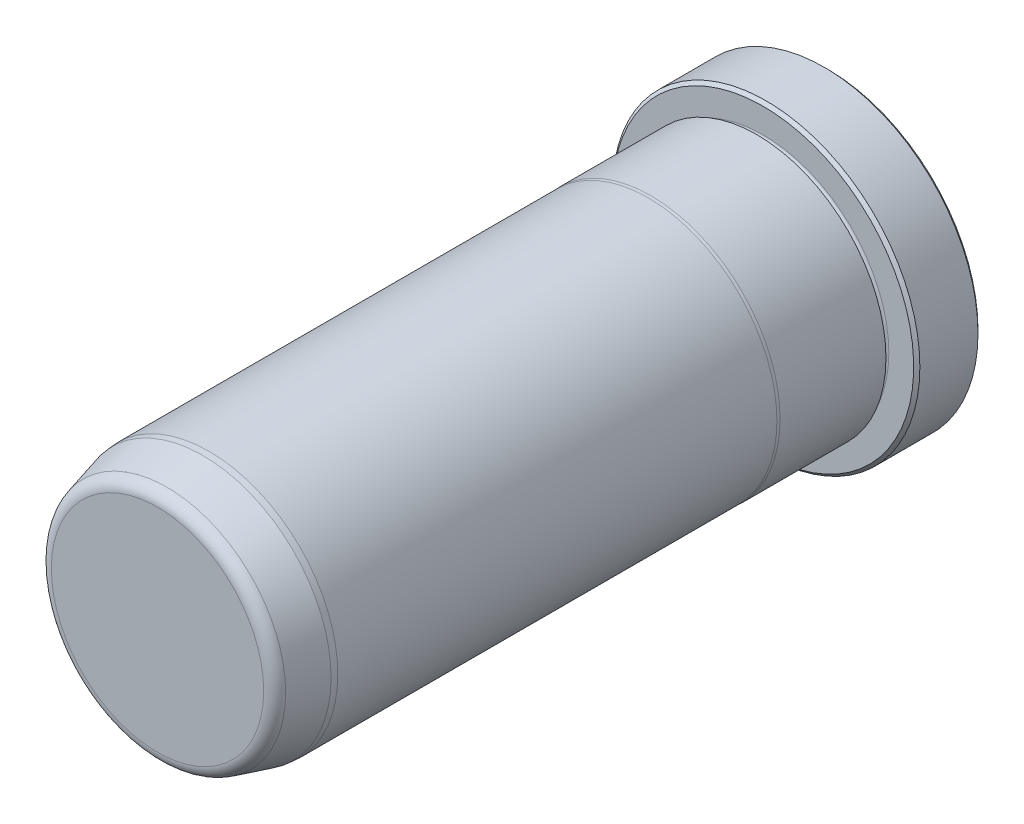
ISO-10303-21;
HEADER;
FILE_DESCRIPTION(('STEP AP214'),'2;1');
FILE_NAME('part.step','',(''),(''),'','','');
FILE_SCHEMA(('AUTOMOTIVE_DESIGN { 1 0 10303 214 1 1 1 1 }'));
ENDSEC;
DATA;
#1=APPLICATION_CONTEXT('core data for automotive mechanical design processes');
#2=APPLICATION_PROTOCOL_DEFINITION('international standard','automotive_design',2000,#1);
#3=PRODUCT_CONTEXT('',#1,'mechanical');
#4=PRODUCT('Part','Part','',(#3));
#5=PRODUCT_RELATED_PRODUCT_CATEGORY('part','',(#4));
#6=PRODUCT_DEFINITION_FORMATION('','',#4);
#7=PRODUCT_DEFINITION_CONTEXT('part definition',#1,'design');
#8=PRODUCT_DEFINITION('design','',#6,#7);
#9=PRODUCT_DEFINITION_SHAPE('','',#8);
#10=(LENGTH_UNIT() NAMED_UNIT(*) SI_UNIT(.MILLI.,.METRE.));
#11=(NAMED_UNIT(*) PLANE_ANGLE_UNIT() SI_UNIT($,.RADIAN.));
#12=(NAMED_UNIT(*) SI_UNIT($,.STERADIAN.) SOLID_ANGLE_UNIT());
#13=UNCERTAINTY_MEASURE_WITH_UNIT(LENGTH_MEASURE(1.E-05),#10,'distance_accuracy_value','');
#14=(GEOMETRIC_REPRESENTATION_CONTEXT(3) GLOBAL_UNCERTAINTY_ASSIGNED_CONTEXT((#13)) GLOBAL_UNIT_ASSIGNED_CONTEXT((#10,
#11,#12)) REPRESENTATION_CONTEXT('',''));
#15=CARTESIAN_POINT('',(0.,0.,0.));
#16=DIRECTION('',(0.,0.,1.));
#17=DIRECTION('',(1.,0.,0.));
#18=AXIS2_PLACEMENT_3D('',#15,#16,#17);
#19=CARTESIAN_POINT('',(0.,0.,0.));
#20=DIRECTION('',(0.,0.,1.));
#21=DIRECTION('',(1.,0.,0.));
#22=AXIS2_PLACEMENT_3D('',#19,#20,#21);
#23=PLANE('',#22);
#24=CARTESIAN_POINT('',(0.,0.,0.));
#25=DIRECTION('',(0.,0.,1.));
#26=DIRECTION('',(1.,0.,0.));
#27=AXIS2_PLACEMENT_3D('',#24,#25,#26);
#28=CIRCLE('',#27,18.542);
#29=CARTESIAN_POINT('',(18.542,0.,0.));
#30=VERTEX_POINT('',#29);
#31=EDGE_CURVE('E37',#30,#30,#28,.F.);
#32=ORIENTED_EDGE('',*,*,#31,.T.);
#33=EDGE_LOOP('',(#32));
#34=FACE_BOUND('',#33,.T.);
#35=ADVANCED_FACE('F30',(#34),#23,.F.);
#36=CARTESIAN_POINT('',(0.,0.,0.));
#37=DIRECTION('',(0.,0.,1.));
#38=DIRECTION('',(1.,0.,0.));
#39=AXIS2_PLACEMENT_3D('',#36,#37,#38);
#40=CYLINDRICAL_SURFACE('',#39,18.923);
#41=CARTESIAN_POINT('',(0.,0.,0.380999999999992));
#42=DIRECTION('',(0.,0.,1.));
#43=DIRECTION('',(1.,0.,0.));
#44=AXIS2_PLACEMENT_3D('',#41,#42,#43);
#45=CIRCLE('',#44,18.923);
#46=CARTESIAN_POINT('',(18.923,0.,0.380999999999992));
#47=VERTEX_POINT('',#46);
#48=EDGE_CURVE('E41',#47,#47,#45,.T.);
#49=ORIENTED_EDGE('',*,*,#48,.T.);
#50=EDGE_LOOP('',(#49));
#51=FACE_BOUND('',#50,.T.);
#52=CARTESIAN_POINT('',(0.,0.,7.5438));
#53=DIRECTION('',(0.,0.,-1.));
#54=DIRECTION('',(-1.,0.,0.));
#55=AXIS2_PLACEMENT_3D('',#52,#53,#54);
#56=CIRCLE('',#55,18.923);
#57=CARTESIAN_POINT('',(-18.923,0.,7.5438));
#58=VERTEX_POINT('',#57);
#59=EDGE_CURVE('E45',#58,#58,#56,.T.);
#60=ORIENTED_EDGE('',*,*,#59,.T.);
#61=EDGE_LOOP('',(#60));
#62=FACE_BOUND('',#61,.T.);
#63=ADVANCED_FACE('F118',(#51,#62),#40,.T.);
#64=CARTESIAN_POINT('',(0.,18.923,7.9248));
#65=DIRECTION('',(0.,0.,-1.));
#66=DIRECTION('',(-1.,0.,0.));
#67=AXIS2_PLACEMENT_3D('',#64,#65,#66);
#68=PLANE('',#67);
#69=CARTESIAN_POINT('',(0.,0.,7.9248));
#70=DIRECTION('',(0.,0.,-1.));
#71=DIRECTION('',(-1.,0.,0.));
#72=AXIS2_PLACEMENT_3D('',#69,#70,#71);
#73=CIRCLE('',#72,18.542);
#74=CARTESIAN_POINT('',(-18.542,0.,7.9248));
#75=VERTEX_POINT('',#74);
#76=EDGE_CURVE('E10',#75,#75,#73,.F.);
#77=ORIENTED_EDGE('',*,*,#76,.T.);
#78=EDGE_LOOP('',(#77));
#79=FACE_BOUND('',#78,.T.);
#80=CARTESIAN_POINT('',(0.,0.,7.9248));
#81=DIRECTION('',(0.,0.,1.));
#82=DIRECTION('',(1.,0.,0.));
#83=AXIS2_PLACEMENT_3D('',#80,#81,#82);
#84=CIRCLE('',#83,15.4813);
#85=CARTESIAN_POINT('',(15.4813,0.,7.9248));
#86=VERTEX_POINT('',#85);
#87=EDGE_CURVE('E56',#86,#86,#84,.T.);
#88=ORIENTED_EDGE('',*,*,#87,.F.);
#89=EDGE_LOOP('',(#88));
#90=FACE_BOUND('',#89,.T.);
#91=ADVANCED_FACE('F113',(#79,#90),#68,.F.);
#92=CARTESIAN_POINT('',(0.,0.,8.3058));
#93=DIRECTION('',(0.,0.,1.));
#94=DIRECTION('',(1.,0.,0.));
#95=AXIS2_PLACEMENT_3D('',#92,#93,#94);
#96=TOROIDAL_SURFACE('',#95,15.4813,0.381000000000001);
#97=CARTESIAN_POINT('',(0.,0.,8.6868));
#98=DIRECTION('',(0.,0.,1.));
#99=DIRECTION('',(1.,0.,0.));
#100=AXIS2_PLACEMENT_3D('',#97,#98,#99);
#101=CIRCLE('',#100,15.4813);
#102=CARTESIAN_POINT('',(15.4813,0.,8.6868));
#103=VERTEX_POINT('',#102);
#104=EDGE_CURVE('E59',#103,#103,#101,.T.);
#105=ORIENTED_EDGE('',*,*,#104,.F.);
#106=EDGE_LOOP('',(#105));
#107=FACE_BOUND('',#106,.T.);
#108=ORIENTED_EDGE('',*,*,#87,.T.);
#109=EDGE_LOOP('',(#108));
#110=FACE_BOUND('',#109,.T.);
#111=ADVANCED_FACE('F107',(#107,#110),#96,.F.);
#112=CARTESIAN_POINT('',(0.,15.4813,8.6868));
#113=DIRECTION('',(0.,0.,1.));
#114=DIRECTION('',(1.,0.,0.));
#115=AXIS2_PLACEMENT_3D('',#112,#113,#114);
#116=PLANE('',#115);
#117=CARTESIAN_POINT('',(0.,0.,8.6868));
#118=DIRECTION('',(0.,0.,1.));
#119=DIRECTION('',(1.,0.,0.));
#120=AXIS2_PLACEMENT_3D('',#117,#118,#119);
#121=CIRCLE('',#120,15.8877);
#122=CARTESIAN_POINT('',(15.8877,0.,8.6868));
#123=VERTEX_POINT('',#122);
#124=EDGE_CURVE('E62',#123,#123,#121,.T.);
#125=ORIENTED_EDGE('',*,*,#124,.F.);
#126=EDGE_LOOP('',(#125));
#127=FACE_BOUND('',#126,.T.);
#128=ORIENTED_EDGE('',*,*,#104,.T.);
#129=EDGE_LOOP('',(#128));
#130=FACE_BOUND('',#129,.T.);
#131=ADVANCED_FACE('F101',(#127,#130),#116,.F.);
#132=CARTESIAN_POINT('',(0.,0.,0.));
#133=DIRECTION('',(0.,0.,1.));
#134=DIRECTION('',(1.,0.,0.));
#135=AXIS2_PLACEMENT_3D('',#132,#133,#134);
#136=CYLINDRICAL_SURFACE('',#135,15.8877);
#137=CARTESIAN_POINT('',(0.,0.,21.7347630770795));
#138=DIRECTION('',(0.,0.,1.));
#139=DIRECTION('',(1.,0.,0.));
#140=AXIS2_PLACEMENT_3D('',#137,#138,#139);
#141=CIRCLE('',#140,15.8877);
#142=CARTESIAN_POINT('',(15.8877,0.,21.7347630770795));
#143=VERTEX_POINT('',#142);
#144=EDGE_CURVE('E65',#143,#143,#141,.T.);
#145=ORIENTED_EDGE('',*,*,#144,.F.);
#146=EDGE_LOOP('',(#145));
#147=FACE_BOUND('',#146,.T.);
#148=ORIENTED_EDGE('',*,*,#124,.T.);
#149=EDGE_LOOP('',(#148));
#150=FACE_BOUND('',#149,.T.);
#151=ADVANCED_FACE('F95',(#147,#150),#136,.T.);
#152=CARTESIAN_POINT('',(0.,0.,21.7347630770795));
#153=DIRECTION('',(0.,0.,-1.));
#154=DIRECTION('',(-1.,0.,0.));
#155=AXIS2_PLACEMENT_3D('',#152,#153,#154);
#156=CONICAL_SURFACE('',#155,15.8877,0.0698131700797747);
#157=CARTESIAN_POINT('',(0.,0.,22.098));
#158=DIRECTION('',(0.,0.,1.));
#159=DIRECTION('',(1.,0.,0.));
#160=AXIS2_PLACEMENT_3D('',#157,#158,#159);
#161=CIRCLE('',#160,15.8623);
#162=CARTESIAN_POINT('',(15.8623,0.,22.098));
#163=VERTEX_POINT('',#162);
#164=EDGE_CURVE('E68',#163,#163,#161,.T.);
#165=ORIENTED_EDGE('',*,*,#164,.F.);
#166=EDGE_LOOP('',(#165));
#167=FACE_BOUND('',#166,.T.);
#168=ORIENTED_EDGE('',*,*,#144,.T.);
#169=EDGE_LOOP('',(#168));
#170=FACE_BOUND('',#169,.T.);
#171=ADVANCED_FACE('F89',(#167,#170),#156,.T.);
#172=CARTESIAN_POINT('',(0.,0.,0.));
#173=DIRECTION('',(0.,0.,1.));
#174=DIRECTION('',(1.,0.,0.));
#175=AXIS2_PLACEMENT_3D('',#172,#173,#174);
#176=CYLINDRICAL_SURFACE('',#175,15.8623);
#177=CARTESIAN_POINT('',(0.,0.,76.2));
#178=DIRECTION('',(0.,0.,1.));
#179=DIRECTION('',(1.,0.,0.));
#180=AXIS2_PLACEMENT_3D('',#177,#178,#179);
#181=CIRCLE('',#180,15.8623);
#182=CARTESIAN_POINT('',(15.8623,0.,76.2));
#183=VERTEX_POINT('',#182);
#184=EDGE_CURVE('E71',#183,#183,#181,.T.);
#185=ORIENTED_EDGE('',*,*,#184,.F.);
#186=EDGE_LOOP('',(#185));
#187=FACE_BOUND('',#186,.T.);
#188=ORIENTED_EDGE('',*,*,#164,.T.);
#189=EDGE_LOOP('',(#188));
#190=FACE_BOUND('',#189,.T.);
#191=ADVANCED_FACE('F83',(#187,#190),#176,.T.);
#192=CARTESIAN_POINT('',(0.,0.,76.2));
#193=DIRECTION('',(0.,0.,-1.));
#194=DIRECTION('',(-1.,0.,0.));
#195=AXIS2_PLACEMENT_3D('',#192,#193,#194);
#196=CONICAL_SURFACE('',#195,15.8623,0.0872664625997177);
#197=CARTESIAN_POINT('',(0.,0.,76.962));
#198=DIRECTION('',(0.,0.,1.));
#199=DIRECTION('',(1.,0.,0.));
#200=AXIS2_PLACEMENT_3D('',#197,#198,#199);
#201=CIRCLE('',#200,15.7956336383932);
#202=CARTESIAN_POINT('',(15.7956336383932,0.,76.962));
#203=VERTEX_POINT('',#202);
#204=EDGE_CURVE('E74',#203,#203,#201,.T.);
#205=ORIENTED_EDGE('',*,*,#204,.F.);
#206=EDGE_LOOP('',(#205));
#207=FACE_BOUND('',#206,.T.);
#208=ORIENTED_EDGE('',*,*,#184,.T.);
#209=EDGE_LOOP('',(#208));
#210=FACE_BOUND('',#209,.T.);
#211=ADVANCED_FACE('F80',(#207,#210),#196,.T.);
#212=CARTESIAN_POINT('',(0.,0.,76.962));
#213=DIRECTION('',(0.,0.,-1.));
#214=DIRECTION('',(-1.,0.,0.));
#215=AXIS2_PLACEMENT_3D('',#212,#213,#214);
#216=CONICAL_SURFACE('',#215,15.7956336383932,0.261799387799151);
#217=CARTESIAN_POINT('',(0.,0.,81.3733752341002));
#218=DIRECTION('',(0.,0.,1.));
#219=DIRECTION('',(1.,0.,0.));
#220=AXIS2_PLACEMENT_3D('',#217,#218,#219);
#221=CIRCLE('',#220,14.6136092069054);
#222=CARTESIAN_POINT('',(14.6136092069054,0.,81.3733752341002));
#223=VERTEX_POINT('',#222);
#224=EDGE_CURVE('E50',#223,#223,#221,.F.);
#225=ORIENTED_EDGE('',*,*,#224,.T.);
#226=EDGE_LOOP('',(#225));
#227=FACE_BOUND('',#226,.T.);
#228=ORIENTED_EDGE('',*,*,#204,.T.);
#229=EDGE_LOOP('',(#228));
#230=FACE_BOUND('',#229,.T.);
#231=ADVANCED_FACE('F78',(#227,#230),#216,.T.);
#232=CARTESIAN_POINT('',(0.,14.2983335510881,82.55));
#233=DIRECTION('',(0.,0.,-1.));
#234=DIRECTION('',(-1.,0.,0.));
#235=AXIS2_PLACEMENT_3D('',#232,#233,#234);
#236=PLANE('',#235);
#237=CARTESIAN_POINT('',(0.,0.,82.55));
#238=DIRECTION('',(0.,0.,-1.));
#239=DIRECTION('',(-1.,0.,0.));
#240=AXIS2_PLACEMENT_3D('',#237,#238,#239);
#241=CIRCLE('',#240,13.0802019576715);
#242=CARTESIAN_POINT('',(-13.0802019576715,0.,82.55));
#243=VERTEX_POINT('',#242);
#244=EDGE_CURVE('E53',#243,#243,#241,.F.);
#245=ORIENTED_EDGE('',*,*,#244,.T.);
#246=EDGE_LOOP('',(#245));
#247=FACE_BOUND('',#246,.T.);
#248=ADVANCED_FACE('F133',(#247),#236,.F.);
#249=CARTESIAN_POINT('',(0.,0.,80.9625));
#250=DIRECTION('',(0.,0.,-1.));
#251=DIRECTION('',(-1.,0.,0.));
#252=AXIS2_PLACEMENT_3D('',#249,#250,#251);
#253=TOROIDAL_SURFACE('',#252,13.0802019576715,1.5875);
#254=ORIENTED_EDGE('',*,*,#224,.F.);
#255=EDGE_LOOP('',(#254));
#256=FACE_BOUND('',#255,.T.);
#257=ORIENTED_EDGE('',*,*,#244,.F.);
#258=EDGE_LOOP('',(#257));
#259=FACE_BOUND('',#258,.T.);
#260=ADVANCED_FACE('F130',(#256,#259),#253,.T.);
#261=CARTESIAN_POINT('',(0.,0.,0.380999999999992));
#262=DIRECTION('',(0.,0.,1.));
#263=DIRECTION('',(1.,0.,0.));
#264=AXIS2_PLACEMENT_3D('',#261,#262,#263);
#265=CONICAL_SURFACE('',#264,18.923,0.785398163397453);
#266=ORIENTED_EDGE('',*,*,#31,.F.);
#267=EDGE_LOOP('',(#266));
#268=FACE_BOUND('',#267,.T.);
#269=ORIENTED_EDGE('',*,*,#48,.F.);
#270=EDGE_LOOP('',(#269));
#271=FACE_BOUND('',#270,.T.);
#272=ADVANCED_FACE('F132',(#268,#271),#265,.T.);
#273=CARTESIAN_POINT('',(0.,0.,7.9248));
#274=DIRECTION('',(0.,0.,-1.));
#275=DIRECTION('',(-1.,0.,0.));
#276=AXIS2_PLACEMENT_3D('',#273,#274,#275);
#277=CONICAL_SURFACE('',#276,18.542,0.785398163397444);
#278=ORIENTED_EDGE('',*,*,#59,.F.);
#279=EDGE_LOOP('',(#278));
#280=FACE_BOUND('',#279,.T.);
#281=ORIENTED_EDGE('',*,*,#76,.F.);
#282=EDGE_LOOP('',(#281));
#283=FACE_BOUND('',#282,.T.);
#284=ADVANCED_FACE('F32',(#280,#283),#277,.T.);
#285=CLOSED_SHELL('',(#35,#63,#91,#111,#131,#151,#171,#191,#211,#231,#248,#260,#272,#284));
#286=MANIFOLD_SOLID_BREP('B2',#285);
#287=ADVANCED_BREP_SHAPE_REPRESENTATION('',(#18,#286),#14);
#288=SHAPE_DEFINITION_REPRESENTATION(#9,#287);
ENDSEC;
END-ISO-10303-21;
